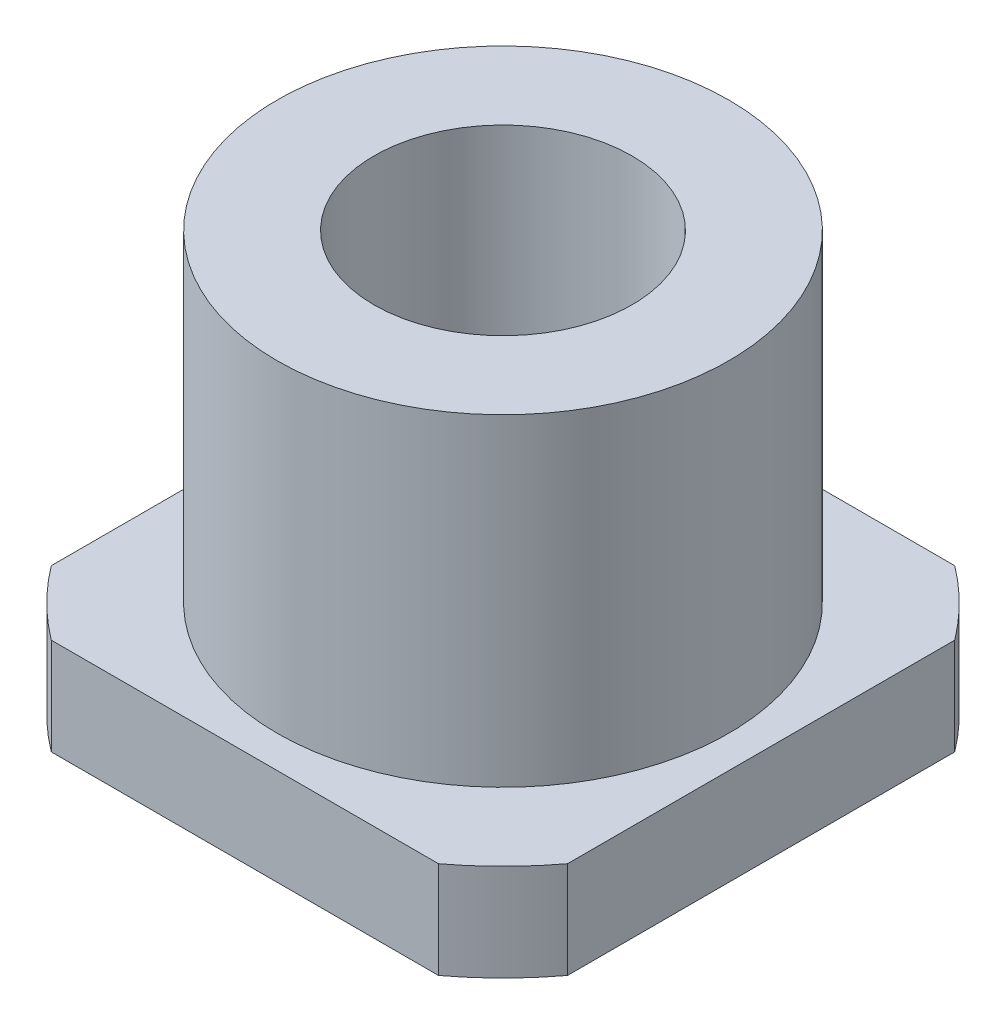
ISO-10303-21;
HEADER;
FILE_DESCRIPTION(('STEP AP214'),'2;1');
FILE_NAME('part.step','',(''),(''),'','','');
FILE_SCHEMA(('AUTOMOTIVE_DESIGN { 1 0 10303 214 1 1 1 1 }'));
ENDSEC;
DATA;
#1=APPLICATION_CONTEXT('core data for automotive mechanical design processes');
#2=APPLICATION_PROTOCOL_DEFINITION('international standard','automotive_design',2000,#1);
#3=PRODUCT_CONTEXT('',#1,'mechanical');
#4=PRODUCT('Part','Part','',(#3));
#5=PRODUCT_RELATED_PRODUCT_CATEGORY('part','',(#4));
#6=PRODUCT_DEFINITION_FORMATION('','',#4);
#7=PRODUCT_DEFINITION_CONTEXT('part definition',#1,'design');
#8=PRODUCT_DEFINITION('design','',#6,#7);
#9=PRODUCT_DEFINITION_SHAPE('','',#8);
#10=(LENGTH_UNIT() NAMED_UNIT(*) SI_UNIT(.MILLI.,.METRE.));
#11=(NAMED_UNIT(*) PLANE_ANGLE_UNIT() SI_UNIT($,.RADIAN.));
#12=(NAMED_UNIT(*) SI_UNIT($,.STERADIAN.) SOLID_ANGLE_UNIT());
#13=UNCERTAINTY_MEASURE_WITH_UNIT(LENGTH_MEASURE(1.E-05),#10,'distance_accuracy_value','');
#14=(GEOMETRIC_REPRESENTATION_CONTEXT(3) GLOBAL_UNCERTAINTY_ASSIGNED_CONTEXT((#13)) GLOBAL_UNIT_ASSIGNED_CONTEXT((#10,
#11,#12)) REPRESENTATION_CONTEXT('',''));
#15=CARTESIAN_POINT('',(0.,0.,0.));
#16=DIRECTION('',(0.,0.,1.));
#17=DIRECTION('',(1.,0.,0.));
#18=AXIS2_PLACEMENT_3D('',#15,#16,#17);
#19=CARTESIAN_POINT('',(0.,-3.,0.));
#20=DIRECTION('',(0.,-1.,0.));
#21=DIRECTION('',(0.,0.,-1.));
#22=AXIS2_PLACEMENT_3D('',#19,#20,#21);
#23=PLANE('',#22);
#24=CARTESIAN_POINT('',(0.,-3.,0.));
#25=DIRECTION('',(0.,-1.,0.));
#26=DIRECTION('',(0.,0.,-1.));
#27=AXIS2_PLACEMENT_3D('',#24,#25,#26);
#28=CIRCLE('',#27,4.);
#29=CARTESIAN_POINT('',(0.,-3.,-4.));
#30=VERTEX_POINT('',#29);
#31=EDGE_CURVE('E245',#30,#30,#28,.T.);
#32=ORIENTED_EDGE('',*,*,#31,.F.);
#33=EDGE_LOOP('',(#32));
#34=FACE_BOUND('',#33,.T.);
#35=CARTESIAN_POINT('',(0.,-3.,0.));
#36=DIRECTION('',(0.,-1.,0.));
#37=DIRECTION('',(0.,0.,-1.));
#38=AXIS2_PLACEMENT_3D('',#35,#36,#37);
#39=CIRCLE('',#38,10.);
#40=CARTESIAN_POINT('',(-6.,-3.,8.));
#41=VERTEX_POINT('',#40);
#42=CARTESIAN_POINT('',(-8.,-3.,6.));
#43=VERTEX_POINT('',#42);
#44=EDGE_CURVE('E137',#41,#43,#39,.T.);
#45=ORIENTED_EDGE('',*,*,#44,.T.);
#46=DIRECTION('',(0.,0.,-1.));
#47=VECTOR('',#46,1.);
#48=CARTESIAN_POINT('',(-8.,-3.,-8.));
#49=LINE('',#48,#47);
#50=CARTESIAN_POINT('',(-8.,-3.,-6.));
#51=VERTEX_POINT('',#50);
#52=EDGE_CURVE('E122',#43,#51,#49,.T.);
#53=ORIENTED_EDGE('',*,*,#52,.T.);
#54=CARTESIAN_POINT('',(-6.,-3.,-8.));
#55=VERTEX_POINT('',#54);
#56=EDGE_CURVE('E128',#51,#55,#39,.T.);
#57=ORIENTED_EDGE('',*,*,#56,.T.);
#58=DIRECTION('',(1.,0.,0.));
#59=VECTOR('',#58,1.);
#60=CARTESIAN_POINT('',(8.,-3.,-8.));
#61=LINE('',#60,#59);
#62=CARTESIAN_POINT('',(6.,-3.,-8.));
#63=VERTEX_POINT('',#62);
#64=EDGE_CURVE('E109',#55,#63,#61,.T.);
#65=ORIENTED_EDGE('',*,*,#64,.T.);
#66=CARTESIAN_POINT('',(8.,-3.,-6.));
#67=VERTEX_POINT('',#66);
#68=EDGE_CURVE('E140',#63,#67,#39,.T.);
#69=ORIENTED_EDGE('',*,*,#68,.T.);
#70=DIRECTION('',(0.,0.,1.));
#71=VECTOR('',#70,1.);
#72=CARTESIAN_POINT('',(8.,-3.,-8.));
#73=LINE('',#72,#71);
#74=CARTESIAN_POINT('',(8.,-3.,6.));
#75=VERTEX_POINT('',#74);
#76=EDGE_CURVE('E121',#67,#75,#73,.T.);
#77=ORIENTED_EDGE('',*,*,#76,.T.);
#78=CARTESIAN_POINT('',(6.,-3.,8.));
#79=VERTEX_POINT('',#78);
#80=EDGE_CURVE('E143',#75,#79,#39,.T.);
#81=ORIENTED_EDGE('',*,*,#80,.T.);
#82=DIRECTION('',(-1.,0.,0.));
#83=VECTOR('',#82,1.);
#84=CARTESIAN_POINT('',(8.,-3.,8.));
#85=LINE('',#84,#83);
#86=EDGE_CURVE('E159',#79,#41,#85,.T.);
#87=ORIENTED_EDGE('',*,*,#86,.T.);
#88=EDGE_LOOP('',(#45,#53,#57,#65,#69,#77,#81,#87));
#89=FACE_BOUND('',#88,.T.);
#90=ADVANCED_FACE('F45',(#34,#89),#23,.T.);
#91=CARTESIAN_POINT('',(0.,0.,0.));
#92=DIRECTION('',(0.,-1.,0.));
#93=DIRECTION('',(0.,0.,-1.));
#94=AXIS2_PLACEMENT_3D('',#91,#92,#93);
#95=PLANE('',#94);
#96=CARTESIAN_POINT('',(0.,0.,0.));
#97=DIRECTION('',(0.,1.,0.));
#98=DIRECTION('',(0.,0.,1.));
#99=AXIS2_PLACEMENT_3D('',#96,#97,#98);
#100=CIRCLE('',#99,7.);
#101=CARTESIAN_POINT('',(0.,0.,7.));
#102=VERTEX_POINT('',#101);
#103=EDGE_CURVE('E149',#102,#102,#100,.T.);
#104=ORIENTED_EDGE('',*,*,#103,.F.);
#105=EDGE_LOOP('',(#104));
#106=FACE_BOUND('',#105,.T.);
#107=DIRECTION('',(0.,0.,-1.));
#108=VECTOR('',#107,1.);
#109=CARTESIAN_POINT('',(-8.,0.,0.));
#110=LINE('',#109,#108);
#111=CARTESIAN_POINT('',(-8.,0.,6.));
#112=VERTEX_POINT('',#111);
#113=CARTESIAN_POINT('',(-8.,0.,-6.));
#114=VERTEX_POINT('',#113);
#115=EDGE_CURVE('E60',#112,#114,#110,.T.);
#116=ORIENTED_EDGE('',*,*,#115,.F.);
#117=CARTESIAN_POINT('',(0.,0.,0.));
#118=DIRECTION('',(0.,-1.,0.));
#119=DIRECTION('',(0.,0.,-1.));
#120=AXIS2_PLACEMENT_3D('',#117,#118,#119);
#121=CIRCLE('',#120,10.);
#122=CARTESIAN_POINT('',(-6.,0.,8.));
#123=VERTEX_POINT('',#122);
#124=EDGE_CURVE('E243',#123,#112,#121,.T.);
#125=ORIENTED_EDGE('',*,*,#124,.F.);
#126=DIRECTION('',(-1.,0.,0.));
#127=VECTOR('',#126,1.);
#128=CARTESIAN_POINT('',(0.,0.,8.));
#129=LINE('',#128,#127);
#130=CARTESIAN_POINT('',(6.,0.,8.));
#131=VERTEX_POINT('',#130);
#132=EDGE_CURVE('E68',#131,#123,#129,.T.);
#133=ORIENTED_EDGE('',*,*,#132,.F.);
#134=CARTESIAN_POINT('',(8.,0.,6.));
#135=VERTEX_POINT('',#134);
#136=EDGE_CURVE('E145',#135,#131,#121,.T.);
#137=ORIENTED_EDGE('',*,*,#136,.F.);
#138=DIRECTION('',(0.,0.,1.));
#139=VECTOR('',#138,1.);
#140=CARTESIAN_POINT('',(8.,0.,0.));
#141=LINE('',#140,#139);
#142=CARTESIAN_POINT('',(8.,0.,-6.));
#143=VERTEX_POINT('',#142);
#144=EDGE_CURVE('E255',#143,#135,#141,.T.);
#145=ORIENTED_EDGE('',*,*,#144,.F.);
#146=CARTESIAN_POINT('',(6.,0.,-8.));
#147=VERTEX_POINT('',#146);
#148=EDGE_CURVE('E138',#147,#143,#121,.T.);
#149=ORIENTED_EDGE('',*,*,#148,.F.);
#150=DIRECTION('',(1.,0.,0.));
#151=VECTOR('',#150,1.);
#152=CARTESIAN_POINT('',(0.,0.,-8.));
#153=LINE('',#152,#151);
#154=CARTESIAN_POINT('',(-6.,0.,-8.));
#155=VERTEX_POINT('',#154);
#156=EDGE_CURVE('E258',#155,#147,#153,.T.);
#157=ORIENTED_EDGE('',*,*,#156,.F.);
#158=EDGE_CURVE('E130',#114,#155,#121,.T.);
#159=ORIENTED_EDGE('',*,*,#158,.F.);
#160=EDGE_LOOP('',(#116,#125,#133,#137,#145,#149,#157,#159));
#161=FACE_BOUND('',#160,.T.);
#162=ADVANCED_FACE('F207',(#106,#161),#95,.F.);
#163=CARTESIAN_POINT('',(0.,-3.,0.));
#164=DIRECTION('',(0.,1.,0.));
#165=DIRECTION('',(0.,0.,1.));
#166=AXIS2_PLACEMENT_3D('',#163,#164,#165);
#167=CYLINDRICAL_SURFACE('',#166,10.);
#168=DIRECTION('',(0.,1.,0.));
#169=VECTOR('',#168,1.);
#170=CARTESIAN_POINT('',(-8.,-3.,6.));
#171=LINE('',#170,#169);
#172=EDGE_CURVE('E11',#43,#112,#171,.T.);
#173=ORIENTED_EDGE('',*,*,#172,.F.);
#174=ORIENTED_EDGE('',*,*,#44,.F.);
#175=DIRECTION('',(0.,1.,0.));
#176=VECTOR('',#175,1.);
#177=CARTESIAN_POINT('',(-6.,-3.,8.));
#178=LINE('',#177,#176);
#179=EDGE_CURVE('E169',#123,#41,#178,.F.);
#180=ORIENTED_EDGE('',*,*,#179,.F.);
#181=ORIENTED_EDGE('',*,*,#124,.T.);
#182=EDGE_LOOP('',(#173,#174,#180,#181));
#183=FACE_BOUND('',#182,.T.);
#184=ADVANCED_FACE('F204',(#183),#167,.T.);
#185=DIRECTION('',(0.,1.,0.));
#186=VECTOR('',#185,1.);
#187=CARTESIAN_POINT('',(-8.,-3.,-6.));
#188=LINE('',#187,#186);
#189=EDGE_CURVE('E54',#114,#51,#188,.F.);
#190=ORIENTED_EDGE('',*,*,#189,.F.);
#191=ORIENTED_EDGE('',*,*,#158,.T.);
#192=DIRECTION('',(0.,1.,0.));
#193=VECTOR('',#192,1.);
#194=CARTESIAN_POINT('',(-6.,-3.,-8.));
#195=LINE('',#194,#193);
#196=EDGE_CURVE('E112',#55,#155,#195,.T.);
#197=ORIENTED_EDGE('',*,*,#196,.F.);
#198=ORIENTED_EDGE('',*,*,#56,.F.);
#199=EDGE_LOOP('',(#190,#191,#197,#198));
#200=FACE_BOUND('',#199,.T.);
#201=ADVANCED_FACE('F127',(#200),#167,.T.);
#202=DIRECTION('',(0.,1.,0.));
#203=VECTOR('',#202,1.);
#204=CARTESIAN_POINT('',(6.,-3.,8.));
#205=LINE('',#204,#203);
#206=EDGE_CURVE('E167',#79,#131,#205,.T.);
#207=ORIENTED_EDGE('',*,*,#206,.F.);
#208=ORIENTED_EDGE('',*,*,#80,.F.);
#209=DIRECTION('',(0.,1.,0.));
#210=VECTOR('',#209,1.);
#211=CARTESIAN_POINT('',(8.,-3.,6.));
#212=LINE('',#211,#210);
#213=EDGE_CURVE('E132',#135,#75,#212,.F.);
#214=ORIENTED_EDGE('',*,*,#213,.F.);
#215=ORIENTED_EDGE('',*,*,#136,.T.);
#216=EDGE_LOOP('',(#207,#208,#214,#215));
#217=FACE_BOUND('',#216,.T.);
#218=ADVANCED_FACE('F164',(#217),#167,.T.);
#219=DIRECTION('',(0.,1.,0.));
#220=VECTOR('',#219,1.);
#221=CARTESIAN_POINT('',(8.,-3.,-6.));
#222=LINE('',#221,#220);
#223=EDGE_CURVE('E173',#67,#143,#222,.T.);
#224=ORIENTED_EDGE('',*,*,#223,.F.);
#225=ORIENTED_EDGE('',*,*,#68,.F.);
#226=DIRECTION('',(0.,1.,0.));
#227=VECTOR('',#226,1.);
#228=CARTESIAN_POINT('',(6.,-3.,-8.));
#229=LINE('',#228,#227);
#230=EDGE_CURVE('E115',#147,#63,#229,.F.);
#231=ORIENTED_EDGE('',*,*,#230,.F.);
#232=ORIENTED_EDGE('',*,*,#148,.T.);
#233=EDGE_LOOP('',(#224,#225,#231,#232));
#234=FACE_BOUND('',#233,.T.);
#235=ADVANCED_FACE('F195',(#234),#167,.T.);
#236=CARTESIAN_POINT('',(0.,10.,0.));
#237=DIRECTION('',(0.,1.,0.));
#238=DIRECTION('',(0.,0.,1.));
#239=AXIS2_PLACEMENT_3D('',#236,#237,#238);
#240=PLANE('',#239);
#241=CARTESIAN_POINT('',(0.,10.,0.));
#242=DIRECTION('',(0.,1.,0.));
#243=DIRECTION('',(0.,0.,1.));
#244=AXIS2_PLACEMENT_3D('',#241,#242,#243);
#245=CIRCLE('',#244,7.);
#246=CARTESIAN_POINT('',(0.,10.,7.));
#247=VERTEX_POINT('',#246);
#248=EDGE_CURVE('E181',#247,#247,#245,.T.);
#249=ORIENTED_EDGE('',*,*,#248,.T.);
#250=EDGE_LOOP('',(#249));
#251=FACE_BOUND('',#250,.T.);
#252=CARTESIAN_POINT('',(0.,10.,0.));
#253=DIRECTION('',(0.,1.,0.));
#254=DIRECTION('',(0.,0.,1.));
#255=AXIS2_PLACEMENT_3D('',#252,#253,#254);
#256=CIRCLE('',#255,4.);
#257=CARTESIAN_POINT('',(0.,10.,4.));
#258=VERTEX_POINT('',#257);
#259=EDGE_CURVE('E154',#258,#258,#256,.T.);
#260=ORIENTED_EDGE('',*,*,#259,.F.);
#261=EDGE_LOOP('',(#260));
#262=FACE_BOUND('',#261,.T.);
#263=ADVANCED_FACE('F193',(#251,#262),#240,.T.);
#264=CARTESIAN_POINT('',(0.,10.,0.));
#265=DIRECTION('',(0.,-1.,0.));
#266=DIRECTION('',(0.,0.,-1.));
#267=AXIS2_PLACEMENT_3D('',#264,#265,#266);
#268=CYLINDRICAL_SURFACE('',#267,7.);
#269=ORIENTED_EDGE('',*,*,#248,.F.);
#270=EDGE_LOOP('',(#269));
#271=FACE_BOUND('',#270,.T.);
#272=ORIENTED_EDGE('',*,*,#103,.T.);
#273=EDGE_LOOP('',(#272));
#274=FACE_BOUND('',#273,.T.);
#275=ADVANCED_FACE('F47',(#271,#274),#268,.T.);
#276=CARTESIAN_POINT('',(0.,10.,0.));
#277=DIRECTION('',(0.,-1.,0.));
#278=DIRECTION('',(0.,0.,-1.));
#279=AXIS2_PLACEMENT_3D('',#276,#277,#278);
#280=CYLINDRICAL_SURFACE('',#279,4.);
#281=ORIENTED_EDGE('',*,*,#259,.T.);
#282=EDGE_LOOP('',(#281));
#283=FACE_BOUND('',#282,.T.);
#284=ORIENTED_EDGE('',*,*,#31,.T.);
#285=EDGE_LOOP('',(#284));
#286=FACE_BOUND('',#285,.T.);
#287=ADVANCED_FACE('F190',(#283,#286),#280,.F.);
#288=CARTESIAN_POINT('',(8.,7.,-8.));
#289=DIRECTION('',(0.,0.,-1.));
#290=DIRECTION('',(-1.,0.,0.));
#291=AXIS2_PLACEMENT_3D('',#288,#289,#290);
#292=PLANE('',#291);
#293=ORIENTED_EDGE('',*,*,#196,.T.);
#294=ORIENTED_EDGE('',*,*,#156,.T.);
#295=ORIENTED_EDGE('',*,*,#230,.T.);
#296=ORIENTED_EDGE('',*,*,#64,.F.);
#297=EDGE_LOOP('',(#293,#294,#295,#296));
#298=FACE_BOUND('',#297,.T.);
#299=ADVANCED_FACE('F111',(#298),#292,.T.);
#300=CARTESIAN_POINT('',(8.,7.,-8.));
#301=DIRECTION('',(1.,0.,0.));
#302=DIRECTION('',(0.,0.,-1.));
#303=AXIS2_PLACEMENT_3D('',#300,#301,#302);
#304=PLANE('',#303);
#305=ORIENTED_EDGE('',*,*,#223,.T.);
#306=ORIENTED_EDGE('',*,*,#144,.T.);
#307=ORIENTED_EDGE('',*,*,#213,.T.);
#308=ORIENTED_EDGE('',*,*,#76,.F.);
#309=EDGE_LOOP('',(#305,#306,#307,#308));
#310=FACE_BOUND('',#309,.T.);
#311=ADVANCED_FACE('F225',(#310),#304,.T.);
#312=CARTESIAN_POINT('',(8.,7.,8.));
#313=DIRECTION('',(0.,0.,1.));
#314=DIRECTION('',(1.,0.,0.));
#315=AXIS2_PLACEMENT_3D('',#312,#313,#314);
#316=PLANE('',#315);
#317=ORIENTED_EDGE('',*,*,#206,.T.);
#318=ORIENTED_EDGE('',*,*,#132,.T.);
#319=ORIENTED_EDGE('',*,*,#179,.T.);
#320=ORIENTED_EDGE('',*,*,#86,.F.);
#321=EDGE_LOOP('',(#317,#318,#319,#320));
#322=FACE_BOUND('',#321,.T.);
#323=ADVANCED_FACE('F229',(#322),#316,.T.);
#324=CARTESIAN_POINT('',(-8.,7.,-8.));
#325=DIRECTION('',(-1.,0.,0.));
#326=DIRECTION('',(0.,0.,1.));
#327=AXIS2_PLACEMENT_3D('',#324,#325,#326);
#328=PLANE('',#327);
#329=ORIENTED_EDGE('',*,*,#172,.T.);
#330=ORIENTED_EDGE('',*,*,#115,.T.);
#331=ORIENTED_EDGE('',*,*,#189,.T.);
#332=ORIENTED_EDGE('',*,*,#52,.F.);
#333=EDGE_LOOP('',(#329,#330,#331,#332));
#334=FACE_BOUND('',#333,.T.);
#335=ADVANCED_FACE('F218',(#334),#328,.T.);
#336=CLOSED_SHELL('',(#90,#162,#184,#201,#218,#235,#263,#275,#287,#299,#311,#323,#335));
#337=MANIFOLD_SOLID_BREP('B2',#336);
#338=ADVANCED_BREP_SHAPE_REPRESENTATION('',(#18,#337),#14);
#339=SHAPE_DEFINITION_REPRESENTATION(#9,#338);
ENDSEC;
END-ISO-10303-21;
